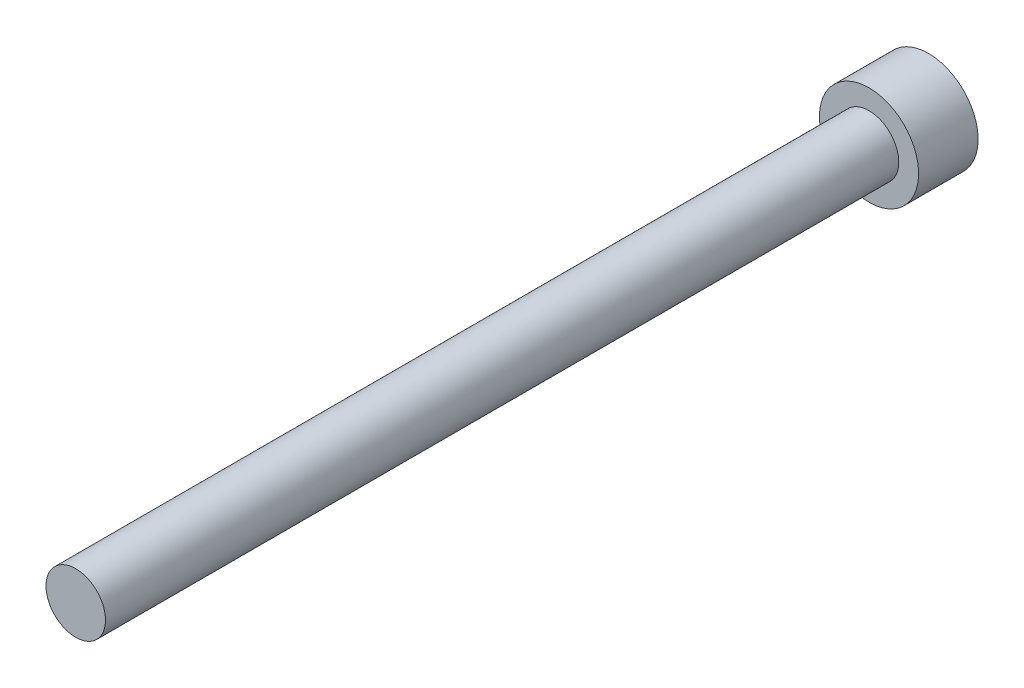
from build123d import *


with BuildPart() as part:
    # Sketch1 → Revolve1 (revolve)
    with BuildSketch(Plane.XZ, mode=Mode.PRIVATE) as revolve1_sk:
        Polygon((1.5, 43), (0, 43), (0, 0), (2.5, 0), (2.5, 3), (1.5, 3), align=None)
    revolve(revolve1_sk.sketch.rotate(Axis((0, 0, 43.000492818), (0, 0, -1)), 180), axis=Axis((0, 0, 43.000492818), (0, 0, -1)))


solid = part.part
